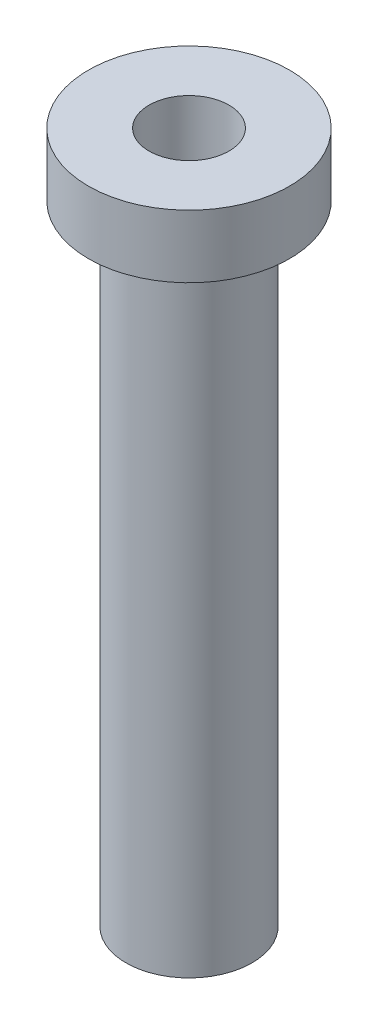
ISO-10303-21;
HEADER;
FILE_DESCRIPTION(('STEP AP214'),'2;1');
FILE_NAME('part.step','',(''),(''),'','','');
FILE_SCHEMA(('AUTOMOTIVE_DESIGN { 1 0 10303 214 1 1 1 1 }'));
ENDSEC;
DATA;
#1=APPLICATION_CONTEXT('core data for automotive mechanical design processes');
#2=APPLICATION_PROTOCOL_DEFINITION('international standard','automotive_design',2000,#1);
#3=PRODUCT_CONTEXT('',#1,'mechanical');
#4=PRODUCT('Part','Part','',(#3));
#5=PRODUCT_RELATED_PRODUCT_CATEGORY('part','',(#4));
#6=PRODUCT_DEFINITION_FORMATION('','',#4);
#7=PRODUCT_DEFINITION_CONTEXT('part definition',#1,'design');
#8=PRODUCT_DEFINITION('design','',#6,#7);
#9=PRODUCT_DEFINITION_SHAPE('','',#8);
#10=(LENGTH_UNIT() NAMED_UNIT(*) SI_UNIT(.MILLI.,.METRE.));
#11=(NAMED_UNIT(*) PLANE_ANGLE_UNIT() SI_UNIT($,.RADIAN.));
#12=(NAMED_UNIT(*) SI_UNIT($,.STERADIAN.) SOLID_ANGLE_UNIT());
#13=UNCERTAINTY_MEASURE_WITH_UNIT(LENGTH_MEASURE(1.E-05),#10,'distance_accuracy_value','');
#14=(GEOMETRIC_REPRESENTATION_CONTEXT(3) GLOBAL_UNCERTAINTY_ASSIGNED_CONTEXT((#13)) GLOBAL_UNIT_ASSIGNED_CONTEXT((#10,
#11,#12)) REPRESENTATION_CONTEXT('',''));
#15=CARTESIAN_POINT('',(0.,0.,0.));
#16=DIRECTION('',(0.,0.,1.));
#17=DIRECTION('',(1.,0.,0.));
#18=AXIS2_PLACEMENT_3D('',#15,#16,#17);
#19=CARTESIAN_POINT('',(0.,-50.,0.));
#20=DIRECTION('',(0.,1.,0.));
#21=DIRECTION('',(0.,0.,1.));
#22=AXIS2_PLACEMENT_3D('',#19,#20,#21);
#23=CONICAL_SURFACE('',#22,0.,1.02974425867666);
#24=CARTESIAN_POINT('',(0.,-48.0922675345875,0.));
#25=DIRECTION('',(0.,-1.,0.));
#26=DIRECTION('',(0.,0.,-1.));
#27=AXIS2_PLACEMENT_3D('',#24,#25,#26);
#28=CIRCLE('',#27,3.175);
#29=CARTESIAN_POINT('',(0.,-48.0922675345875,-3.175));
#30=VERTEX_POINT('',#29);
#31=EDGE_CURVE('E11',#30,#30,#28,.T.);
#32=ORIENTED_EDGE('',*,*,#31,.F.);
#33=EDGE_LOOP('',(#32));
#34=FACE_BOUND('',#33,.T.);
#35=CARTESIAN_POINT('',(0.,-50.,0.));
#36=VERTEX_POINT('',#35);
#37=VERTEX_LOOP('',#36);
#38=FACE_BOUND('',#37,.T.);
#39=ADVANCED_FACE('F34',(#34,#38),#23,.F.);
#40=CARTESIAN_POINT('',(0.,-55.,0.));
#41=DIRECTION('',(0.,-1.,0.));
#42=DIRECTION('',(0.,0.,-1.));
#43=AXIS2_PLACEMENT_3D('',#40,#41,#42);
#44=CYLINDRICAL_SURFACE('',#43,3.175);
#45=ORIENTED_EDGE('',*,*,#31,.T.);
#46=EDGE_LOOP('',(#45));
#47=FACE_BOUND('',#46,.T.);
#48=CARTESIAN_POINT('',(0.,0.,0.));
#49=DIRECTION('',(0.,-1.,0.));
#50=DIRECTION('',(0.,0.,-1.));
#51=AXIS2_PLACEMENT_3D('',#48,#49,#50);
#52=CIRCLE('',#51,3.17500000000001);
#53=CARTESIAN_POINT('',(0.,0.,-3.17500000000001));
#54=VERTEX_POINT('',#53);
#55=EDGE_CURVE('E40',#54,#54,#52,.T.);
#56=ORIENTED_EDGE('',*,*,#55,.F.);
#57=EDGE_LOOP('',(#56));
#58=FACE_BOUND('',#57,.T.);
#59=ADVANCED_FACE('F44',(#47,#58),#44,.F.);
#60=CARTESIAN_POINT('',(0.,0.,0.));
#61=DIRECTION('',(0.,-1.,0.));
#62=DIRECTION('',(0.,0.,-1.));
#63=AXIS2_PLACEMENT_3D('',#60,#61,#62);
#64=PLANE('',#63);
#65=CARTESIAN_POINT('',(0.,0.,0.));
#66=DIRECTION('',(0.,-1.,0.));
#67=DIRECTION('',(0.,0.,-1.));
#68=AXIS2_PLACEMENT_3D('',#65,#66,#67);
#69=CIRCLE('',#68,8.00000000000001);
#70=CARTESIAN_POINT('',(0.,0.,-8.00000000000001));
#71=VERTEX_POINT('',#70);
#72=EDGE_CURVE('E56',#71,#71,#69,.T.);
#73=ORIENTED_EDGE('',*,*,#72,.F.);
#74=EDGE_LOOP('',(#73));
#75=FACE_BOUND('',#74,.T.);
#76=ORIENTED_EDGE('',*,*,#55,.T.);
#77=EDGE_LOOP('',(#76));
#78=FACE_BOUND('',#77,.T.);
#79=ADVANCED_FACE('F49',(#75,#78),#64,.F.);
#80=CARTESIAN_POINT('',(0.,-55.,0.));
#81=DIRECTION('',(0.,-1.,0.));
#82=DIRECTION('',(0.,0.,-1.));
#83=AXIS2_PLACEMENT_3D('',#80,#81,#82);
#84=CYLINDRICAL_SURFACE('',#83,8.00000000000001);
#85=CARTESIAN_POINT('',(0.,-5.,0.));
#86=DIRECTION('',(0.,-1.,0.));
#87=DIRECTION('',(0.,0.,-1.));
#88=AXIS2_PLACEMENT_3D('',#85,#86,#87);
#89=CIRCLE('',#88,8.00000000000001);
#90=CARTESIAN_POINT('',(0.,-5.,-8.00000000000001));
#91=VERTEX_POINT('',#90);
#92=EDGE_CURVE('E58',#91,#91,#89,.T.);
#93=ORIENTED_EDGE('',*,*,#92,.F.);
#94=EDGE_LOOP('',(#93));
#95=FACE_BOUND('',#94,.T.);
#96=ORIENTED_EDGE('',*,*,#72,.T.);
#97=EDGE_LOOP('',(#96));
#98=FACE_BOUND('',#97,.T.);
#99=ADVANCED_FACE('F81',(#95,#98),#84,.T.);
#100=CARTESIAN_POINT('',(0.,-5.,0.));
#101=DIRECTION('',(0.,1.,0.));
#102=DIRECTION('',(0.,0.,1.));
#103=AXIS2_PLACEMENT_3D('',#100,#101,#102);
#104=PLANE('',#103);
#105=CARTESIAN_POINT('',(0.,-5.,0.));
#106=DIRECTION('',(0.,-1.,0.));
#107=DIRECTION('',(0.,0.,-1.));
#108=AXIS2_PLACEMENT_3D('',#105,#106,#107);
#109=CIRCLE('',#108,5.01269000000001);
#110=CARTESIAN_POINT('',(0.,-5.,-5.01269000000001));
#111=VERTEX_POINT('',#110);
#112=EDGE_CURVE('E63',#111,#111,#109,.T.);
#113=ORIENTED_EDGE('',*,*,#112,.F.);
#114=EDGE_LOOP('',(#113));
#115=FACE_BOUND('',#114,.T.);
#116=ORIENTED_EDGE('',*,*,#92,.T.);
#117=EDGE_LOOP('',(#116));
#118=FACE_BOUND('',#117,.T.);
#119=ADVANCED_FACE('F75',(#115,#118),#104,.F.);
#120=CARTESIAN_POINT('',(0.,-55.,0.));
#121=DIRECTION('',(0.,-1.,0.));
#122=DIRECTION('',(0.,0.,-1.));
#123=AXIS2_PLACEMENT_3D('',#120,#121,#122);
#124=CYLINDRICAL_SURFACE('',#123,5.01269);
#125=CARTESIAN_POINT('',(0.,-55.,0.));
#126=DIRECTION('',(0.,-1.,0.));
#127=DIRECTION('',(0.,0.,-1.));
#128=AXIS2_PLACEMENT_3D('',#125,#126,#127);
#129=CIRCLE('',#128,5.01269);
#130=CARTESIAN_POINT('',(0.,-55.,-5.01269));
#131=VERTEX_POINT('',#130);
#132=EDGE_CURVE('E66',#131,#131,#129,.T.);
#133=ORIENTED_EDGE('',*,*,#132,.F.);
#134=EDGE_LOOP('',(#133));
#135=FACE_BOUND('',#134,.T.);
#136=ORIENTED_EDGE('',*,*,#112,.T.);
#137=EDGE_LOOP('',(#136));
#138=FACE_BOUND('',#137,.T.);
#139=ADVANCED_FACE('F72',(#135,#138),#124,.T.);
#140=CARTESIAN_POINT('',(0.,-55.,0.));
#141=DIRECTION('',(0.,1.,0.));
#142=DIRECTION('',(0.,0.,1.));
#143=AXIS2_PLACEMENT_3D('',#140,#141,#142);
#144=PLANE('',#143);
#145=ORIENTED_EDGE('',*,*,#132,.T.);
#146=EDGE_LOOP('',(#145));
#147=FACE_BOUND('',#146,.T.);
#148=ADVANCED_FACE('F70',(#147),#144,.F.);
#149=CLOSED_SHELL('',(#39,#59,#79,#99,#119,#139,#148));
#150=MANIFOLD_SOLID_BREP('B2',#149);
#151=ADVANCED_BREP_SHAPE_REPRESENTATION('',(#18,#150),#14);
#152=SHAPE_DEFINITION_REPRESENTATION(#9,#151);
ENDSEC;
END-ISO-10303-21;
